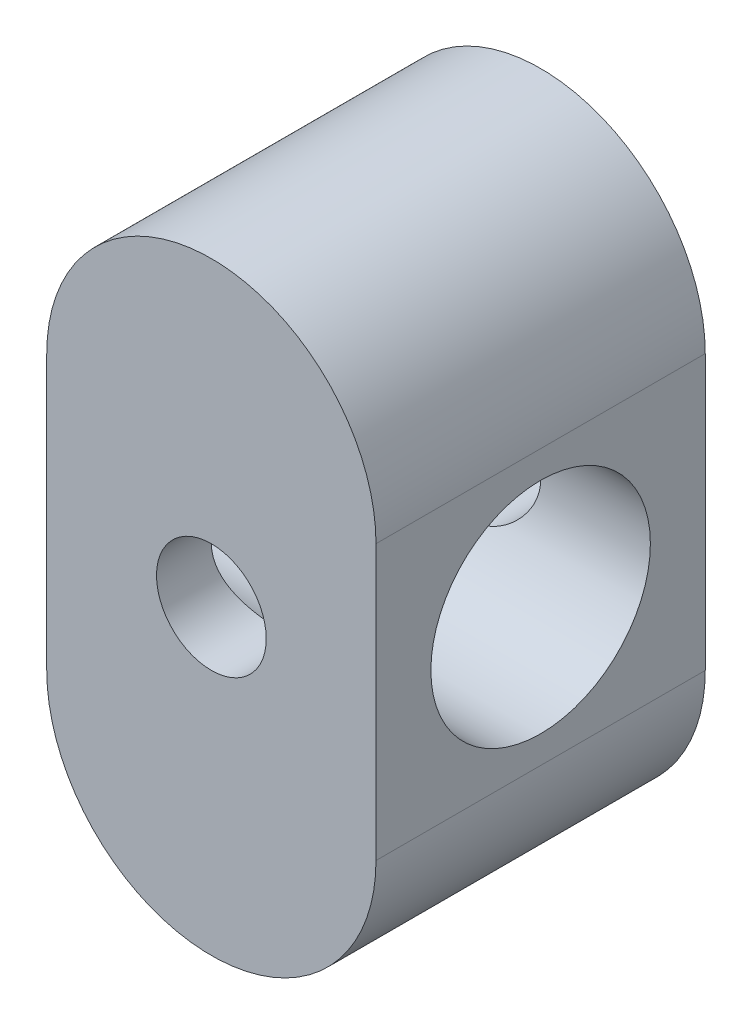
from build123d import *

# Parameters (mm, degrees)
SKETCH1_W          = 38.1
SKETCH1_H          = 69.85
SKETCH1_R          = 6.35
EXTRUDE1_DEPTH     = 38.1
FILLET1_RADIUS     = 19.05
FILLET1_LENGTH     = 38.1
FILLET2_RADIUS     = 19.05
FILLET2_LENGTH     = 38.1
SKETCH2_R          = 12.7
CUT_EXTRUDE1_DEPTH = 65.210401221


with BuildPart() as part:
    # Sketch1 → Extrude1 (new body)
    with BuildSketch(Plane.XY):
        Rectangle(SKETCH1_W, SKETCH1_H)
        with Locations(Location((0, 0, 0), (0, 0, 180))):
            Circle(SKETCH1_R, mode=Mode.SUBTRACT)
    extrude(amount=EXTRUDE1_DEPTH)

    # Fillet1: full round fillet: the end face becomes a half cylinder, R = half its width
    fillet1_face = Plane((0, 34.925, 19.05), x_dir=(0, 0, 1), z_dir=(0, 1, 0))  # on the end face: x along it, z out of the body
    fillet1_slab = fillet1_face.offset(-FILLET1_RADIUS / 2) * Box(FILLET1_LENGTH, 2 * FILLET1_RADIUS, FILLET1_RADIUS, mode=Mode.PRIVATE)  # the body's end, R deep
    fillet1_round = Plane((0, 15.875, 19.05), x_dir=(0, 1, 0), z_dir=(0, 0, 1)) * Cylinder(FILLET1_RADIUS, FILLET1_LENGTH, mode=Mode.PRIVATE)  # its axis R under the face
    add(fillet1_slab - fillet1_round, mode=Mode.SUBTRACT)

    # Fillet2: full round fillet: the end face becomes a half cylinder, R = half its width
    fillet2_face = Plane((0, -34.925, 19.05), x_dir=(0, 0, 1), z_dir=(0, -1, 0))  # on the end face: x along it, z out of the body
    fillet2_slab = fillet2_face.offset(-FILLET2_RADIUS / 2) * Box(FILLET2_LENGTH, 2 * FILLET2_RADIUS, FILLET2_RADIUS, mode=Mode.PRIVATE)  # the body's end, R deep
    fillet2_round = Plane((0, -15.875, 19.05), x_dir=(0, -1, 0), z_dir=(0, 0, 1)) * Cylinder(FILLET2_RADIUS, FILLET2_LENGTH, mode=Mode.PRIVATE)  # its axis R under the face
    add(fillet2_slab - fillet2_round, mode=Mode.SUBTRACT)

    # Sketch2 → Cut-Extrude1 (cut, through all)
    with BuildSketch(Plane.ZY.offset(19.05)):
        with Locations(Location((19.05, 0, 0), (0, 0, 270))):
            Circle(SKETCH2_R)
    extrude(amount=-CUT_EXTRUDE1_DEPTH, mode=Mode.SUBTRACT)


solid = part.part
